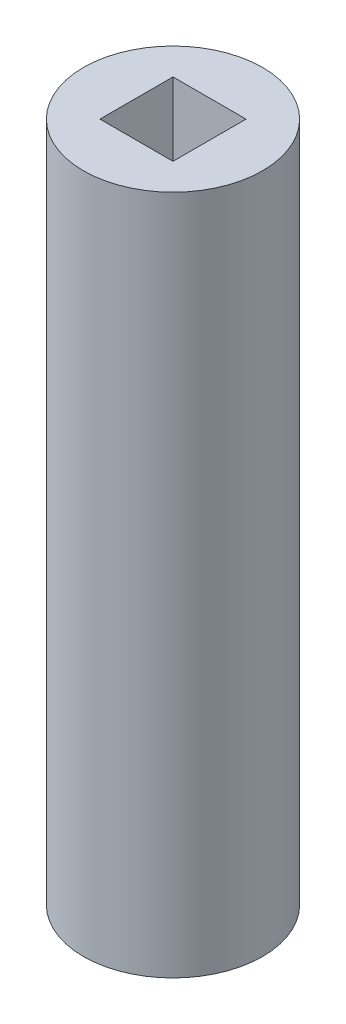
from build123d import *

# Parameters (mm, degrees)
SKETCH_1_R      = 12.5
SKETCH_1_W      = 10.2
SKETCH_1_H      = 10.2
EXTRUDE_1_DEPTH = 95


with BuildPart() as part:
    # Sketch 1 → Extrude 1 (new body)
    with BuildSketch(Plane(origin=(0, 0, 0), x_dir=(1, 0, 0), z_dir=(0, 1, 0))):
        with Locations(Location((0, 0, 0), (0, 0, 270))):
            Circle(SKETCH_1_R)
        Rectangle(SKETCH_1_W, SKETCH_1_H, mode=Mode.SUBTRACT)
    extrude(amount=EXTRUDE_1_DEPTH)


solid = part.part
